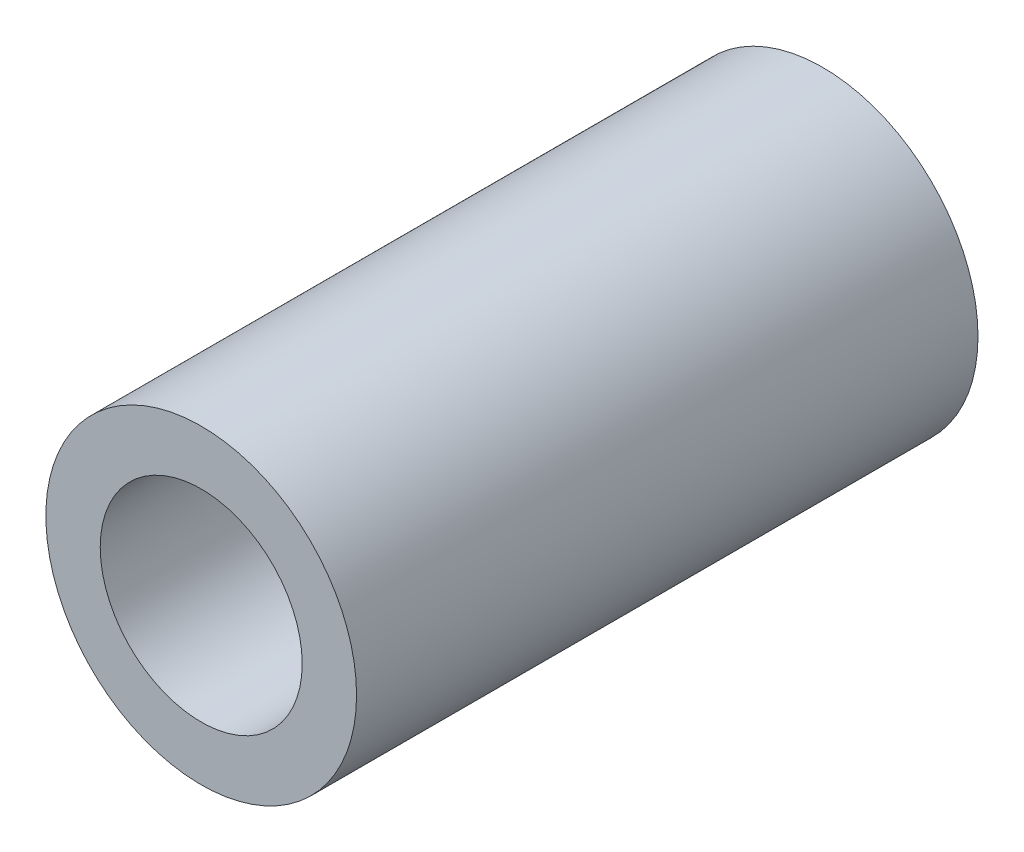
from build123d import *

# Parameters (mm, degrees)
SKETCH1_R      = 5
SKETCH1_R_2    = 3.25
EXTRUDE1_DEPTH = 20


with BuildPart() as part:
    # Sketch1 → Extrude1 (new body)
    with BuildSketch(Plane.XY):
        Circle(SKETCH1_R)
        Circle(SKETCH1_R_2, mode=Mode.SUBTRACT)
    extrude(amount=EXTRUDE1_DEPTH)


solid = part.part
